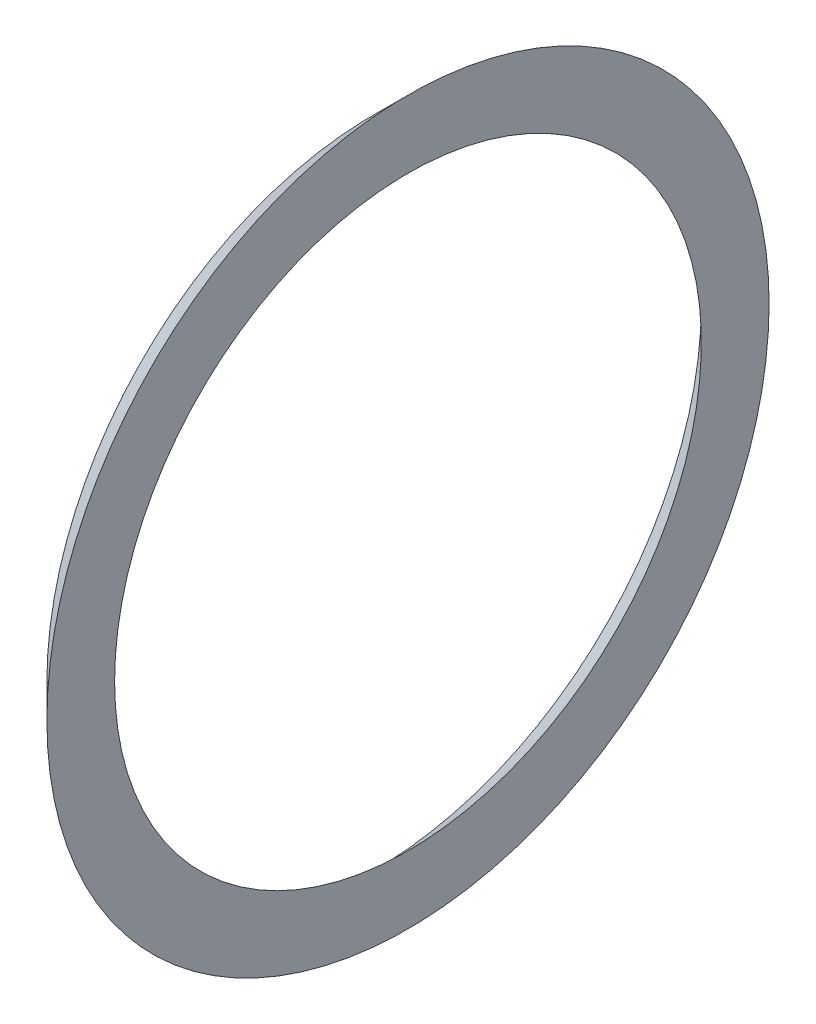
ISO-10303-21;
HEADER;
FILE_DESCRIPTION(('STEP AP214'),'2;1');
FILE_NAME('part.step','',(''),(''),'','','');
FILE_SCHEMA(('AUTOMOTIVE_DESIGN { 1 0 10303 214 1 1 1 1 }'));
ENDSEC;
DATA;
#1=APPLICATION_CONTEXT('core data for automotive mechanical design processes');
#2=APPLICATION_PROTOCOL_DEFINITION('international standard','automotive_design',2000,#1);
#3=PRODUCT_CONTEXT('',#1,'mechanical');
#4=PRODUCT('Part','Part','',(#3));
#5=PRODUCT_RELATED_PRODUCT_CATEGORY('part','',(#4));
#6=PRODUCT_DEFINITION_FORMATION('','',#4);
#7=PRODUCT_DEFINITION_CONTEXT('part definition',#1,'design');
#8=PRODUCT_DEFINITION('design','',#6,#7);
#9=PRODUCT_DEFINITION_SHAPE('','',#8);
#10=(LENGTH_UNIT() NAMED_UNIT(*) SI_UNIT(.MILLI.,.METRE.));
#11=(NAMED_UNIT(*) PLANE_ANGLE_UNIT() SI_UNIT($,.RADIAN.));
#12=(NAMED_UNIT(*) SI_UNIT($,.STERADIAN.) SOLID_ANGLE_UNIT());
#13=UNCERTAINTY_MEASURE_WITH_UNIT(LENGTH_MEASURE(1.E-05),#10,'distance_accuracy_value','');
#14=(GEOMETRIC_REPRESENTATION_CONTEXT(3) GLOBAL_UNCERTAINTY_ASSIGNED_CONTEXT((#13)) GLOBAL_UNIT_ASSIGNED_CONTEXT((#10,
#11,#12)) REPRESENTATION_CONTEXT('',''));
#15=CARTESIAN_POINT('',(0.,0.,0.));
#16=DIRECTION('',(0.,0.,1.));
#17=DIRECTION('',(1.,0.,0.));
#18=AXIS2_PLACEMENT_3D('',#15,#16,#17);
#19=CARTESIAN_POINT('',(60.7516600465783,11.0027630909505,0.57122631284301));
#20=DIRECTION('',(1.,0.,0.));
#21=DIRECTION('',(0.,0.,-1.));
#22=AXIS2_PLACEMENT_3D('',#19,#20,#21);
#23=CONICAL_SURFACE('',#22,72.5,0.78539816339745);
#24=CARTESIAN_POINT('',(68.2516600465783,11.0027630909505,0.57122631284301));
#25=DIRECTION('',(1.,0.,0.));
#26=DIRECTION('',(0.,0.,-1.));
#27=AXIS2_PLACEMENT_3D('',#24,#25,#26);
#28=CIRCLE('',#27,80.);
#29=CARTESIAN_POINT('',(68.2516600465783,11.0027630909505,-79.428773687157));
#30=VERTEX_POINT('',#29);
#31=EDGE_CURVE('E59',#30,#30,#28,.F.);
#32=ORIENTED_EDGE('',*,*,#31,.T.);
#33=EDGE_LOOP('',(#32));
#34=FACE_BOUND('',#33,.T.);
#35=CARTESIAN_POINT('',(60.7516600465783,11.0027630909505,0.57122631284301));
#36=DIRECTION('',(-1.,0.,0.));
#37=DIRECTION('',(0.,0.,1.));
#38=AXIS2_PLACEMENT_3D('',#35,#36,#37);
#39=CIRCLE('',#38,72.5);
#40=CARTESIAN_POINT('',(60.7516600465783,11.0027630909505,73.071226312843));
#41=VERTEX_POINT('',#40);
#42=EDGE_CURVE('E66',#41,#41,#39,.T.);
#43=ORIENTED_EDGE('',*,*,#42,.F.);
#44=EDGE_LOOP('',(#43));
#45=FACE_BOUND('',#44,.T.);
#46=ADVANCED_FACE('F55',(#34,#45),#23,.T.);
#47=CARTESIAN_POINT('',(68.2516600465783,11.0027630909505,0.57122631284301));
#48=DIRECTION('',(-1.,0.,0.));
#49=DIRECTION('',(0.,0.,1.));
#50=AXIS2_PLACEMENT_3D('',#47,#48,#49);
#51=CONICAL_SURFACE('',#50,65.,0.785398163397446);
#52=ORIENTED_EDGE('',*,*,#42,.T.);
#53=EDGE_LOOP('',(#52));
#54=FACE_BOUND('',#53,.T.);
#55=CARTESIAN_POINT('',(68.2516600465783,11.0027630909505,0.57122631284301));
#56=DIRECTION('',(-1.,0.,0.));
#57=DIRECTION('',(0.,0.,1.));
#58=AXIS2_PLACEMENT_3D('',#55,#56,#57);
#59=CIRCLE('',#58,65.);
#60=CARTESIAN_POINT('',(68.2516600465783,11.0027630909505,65.5712263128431));
#61=VERTEX_POINT('',#60);
#62=EDGE_CURVE('E11',#61,#61,#59,.F.);
#63=ORIENTED_EDGE('',*,*,#62,.T.);
#64=EDGE_LOOP('',(#63));
#65=FACE_BOUND('',#64,.T.);
#66=ADVANCED_FACE('F71',(#54,#65),#51,.F.);
#67=CARTESIAN_POINT('',(68.2516600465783,-1.8493276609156,64.7158057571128));
#68=DIRECTION('',(-1.,0.,0.));
#69=DIRECTION('',(0.,-0.196456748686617,0.980512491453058));
#70=AXIS2_PLACEMENT_3D('',#67,#68,#69);
#71=PLANE('',#70);
#72=ORIENTED_EDGE('',*,*,#62,.F.);
#73=EDGE_LOOP('',(#72));
#74=FACE_BOUND('',#73,.T.);
#75=ORIENTED_EDGE('',*,*,#31,.F.);
#76=EDGE_LOOP('',(#75));
#77=FACE_BOUND('',#76,.T.);
#78=ADVANCED_FACE('F57',(#74,#77),#71,.F.);
#79=CLOSED_SHELL('',(#46,#66,#78));
#80=MANIFOLD_SOLID_BREP('B2',#79);
#81=ADVANCED_BREP_SHAPE_REPRESENTATION('',(#18,#80),#14);
#82=SHAPE_DEFINITION_REPRESENTATION(#9,#81);
ENDSEC;
END-ISO-10303-21;
